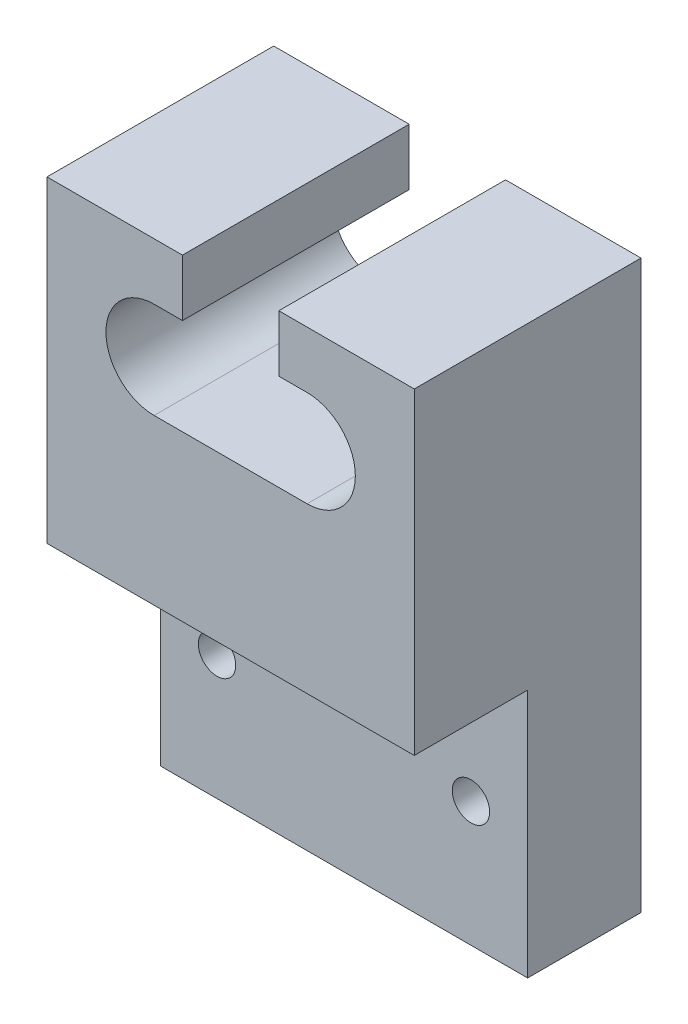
from build123d import *

# Parameters (mm, degrees)
EXTRUDE_2_DEPTH          = 20
CUT_EXTRUDE_1_DEPTH      = 63.847116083
CUT_EXTRUDE_1_DEPTH_BACK = 63.847116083
SKETCH_6_R               = 1.65
CUT_EXTRUDE_2_DEPTH      = 20


with BuildPart() as part:
    # Sketch 4 → Extrude 2 (new body)
    with BuildSketch(Plane.XY):
        with BuildLine():
            Line((0, 0), (0, 50))
            Line((0, 50), (11.95, 50))
            Line((11.95, 50), (11.95, 45))
            Line((11.95, 45), (9.45, 45))
            ThreePointArc((9.45, 45), (5.2, 40.75), (9.45, 36.5))
            Line((9.45, 36.5), (22.95, 36.5))
            ThreePointArc((22.95, 36.5), (27.2, 40.75), (22.95, 45))
            Line((22.95, 45), (20.45, 45))
            Line((20.45, 45), (20.45, 50))
            Line((20.45, 50), (32.4, 50))
            Line((32.4, 50), (32.4, 0))
            Line((32.4, 0), (0, 0))
        make_face()
    extrude(amount=EXTRUDE_2_DEPTH)

    # Sketch 5 → Cut-Extrude 1 (cut, two sides: drawn at the far end of the back side and taken through both)
    with BuildSketch(Plane(origin=(32.4, 0, 0), x_dir=(0, 0, -1), z_dir=(1, 0, 0)).offset(-CUT_EXTRUDE_1_DEPTH_BACK)):
        Polygon((-10, -111.980390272), (-10, 0), (-10, 22), (-20, 22), (-131.980390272, 22), (-297.587138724, -128.774122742), (-175.606748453, -262.754513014), align=None)
    extrude(amount=CUT_EXTRUDE_1_DEPTH + CUT_EXTRUDE_1_DEPTH_BACK, mode=Mode.SUBTRACT)

    # Sketch 6 → Cut-Extrude 2 (cut)
    with BuildSketch(Plane.XY.offset(10)):
        with Locations((5, 11)):
            Circle(SKETCH_6_R)
        with Locations((27.4, 11)):
            Circle(SKETCH_6_R)
    extrude(amount=-CUT_EXTRUDE_2_DEPTH, mode=Mode.SUBTRACT)


solid = part.part
